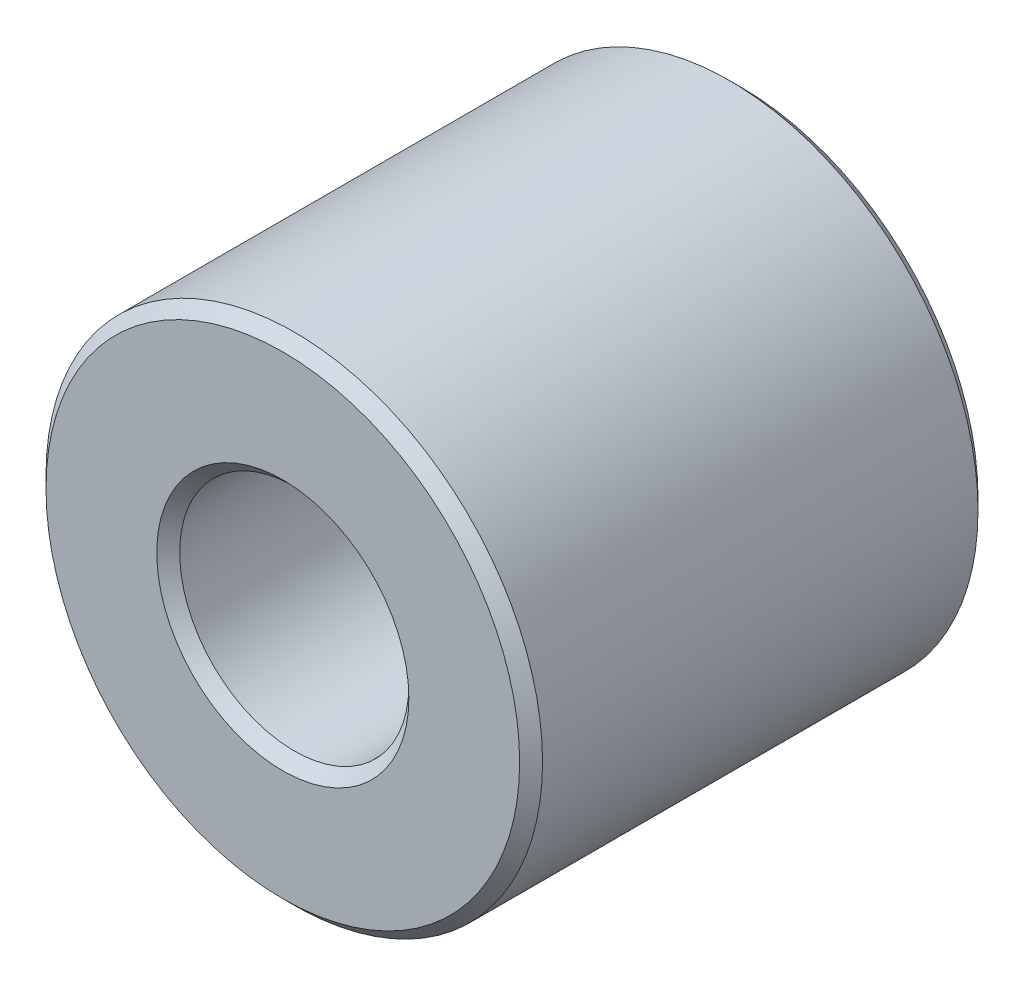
from build123d import *

# Parameters (mm, degrees)
SKETCH1_R           = 13
SKETCH1_R_2         = 6
BOSS_EXTRUDE1_DEPTH = 12
CHAMFER1_SIZE       = 0.6


with BuildPart() as part:
    # Sketch1 → Boss-Extrude1 (new, symmetric)
    with BuildSketch(Plane.XY):
        Circle(SKETCH1_R)
        Circle(SKETCH1_R_2, mode=Mode.SUBTRACT)
    extrude(amount=BOSS_EXTRUDE1_DEPTH, both=True)

    # Chamfer1
    chamfer1_edges = [part.edges().sort_by_distance(p)[0] for p in [
        (-13, 0, -12),
        (-13, 0, 12),
        (-6, 0, -12),
        (-6, 0, 12),
    ]]
    chamfer(chamfer1_edges, length=CHAMFER1_SIZE)


solid = part.part
